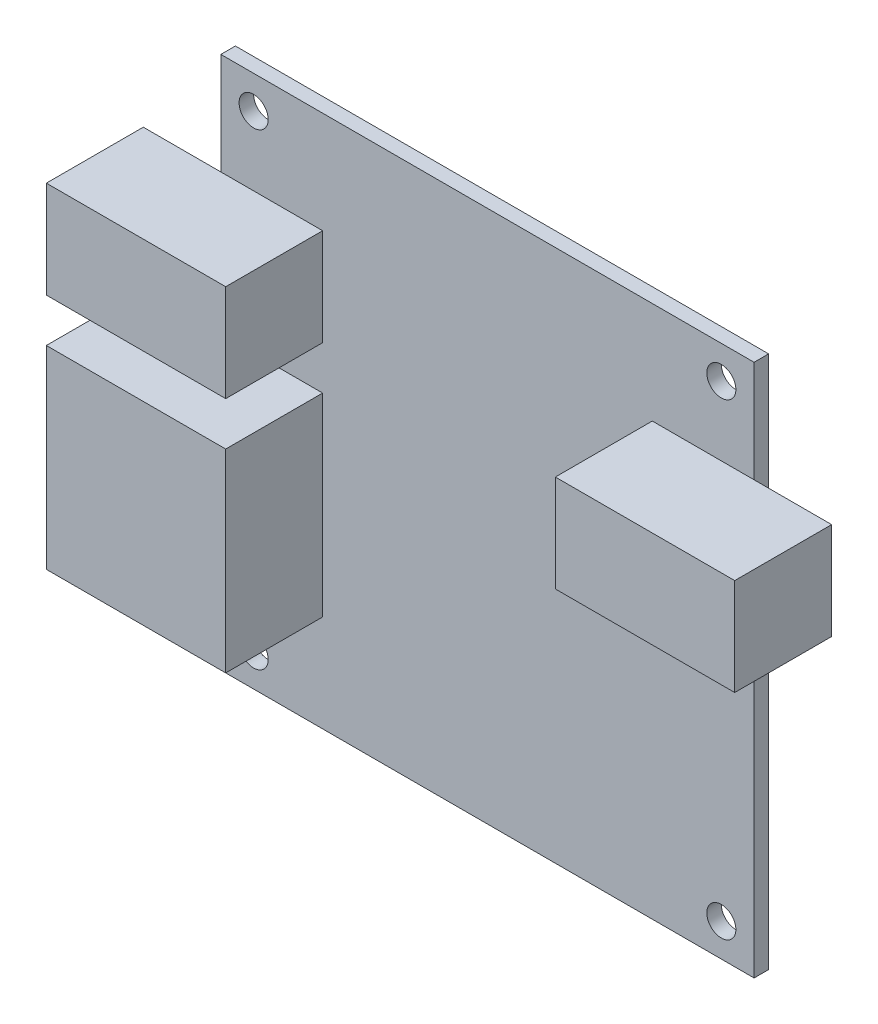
from build123d import *

# Parameters (mm, degrees)
ESQUISSE1_W             = 55
ESQUISSE1_H             = 55
BOSS_EXTRU_1_DEPTH      = 1.5
ESQUISSE2_R             = 1.5
ENL_V_MAT_EXTRU_1_DEPTH = 39.919789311
ESQUISSE3_W             = 18.5
ESQUISSE3_H             = 10
ESQUISSE3_H_2           = 20
BOSS_EXTRU_2_DEPTH      = 10


with BuildPart() as part:
    # Esquisse1 → Boss.-Extru.1 (new body)
    with BuildSketch(Plane.XY):
        Rectangle(ESQUISSE1_W, ESQUISSE1_H)
    extrude(amount=BOSS_EXTRU_1_DEPTH)

    # Esquisse2 → Enl_v. mat.-Extru.1 (cut, through all)
    with BuildSketch(Plane.XY.offset(1.5)):
        with Locations((-24.12, 24.12)):
            Circle(ESQUISSE2_R)
        with Locations((-24.12, -24.12)):
            Circle(ESQUISSE2_R)
        with Locations((24.12, -24.12)):
            Circle(ESQUISSE2_R)
        with Locations((24.12, 24.12)):
            Circle(ESQUISSE2_R)
    extrude(amount=-ENL_V_MAT_EXTRU_1_DEPTH, mode=Mode.SUBTRACT)

    # Esquisse3 → Boss.-Extru.2 (add)
    with BuildSketch(Plane.XY.offset(1.5)):
        with Locations((-26.25, 12)):
            Rectangle(ESQUISSE3_W, ESQUISSE3_H)
        with Locations((-26.25, -7.5)):
            Rectangle(ESQUISSE3_W, ESQUISSE3_H_2)
        with Locations((26.25, 12)):
            Rectangle(ESQUISSE3_W, ESQUISSE3_H)
    extrude(amount=BOSS_EXTRU_2_DEPTH)


solid = part.part
